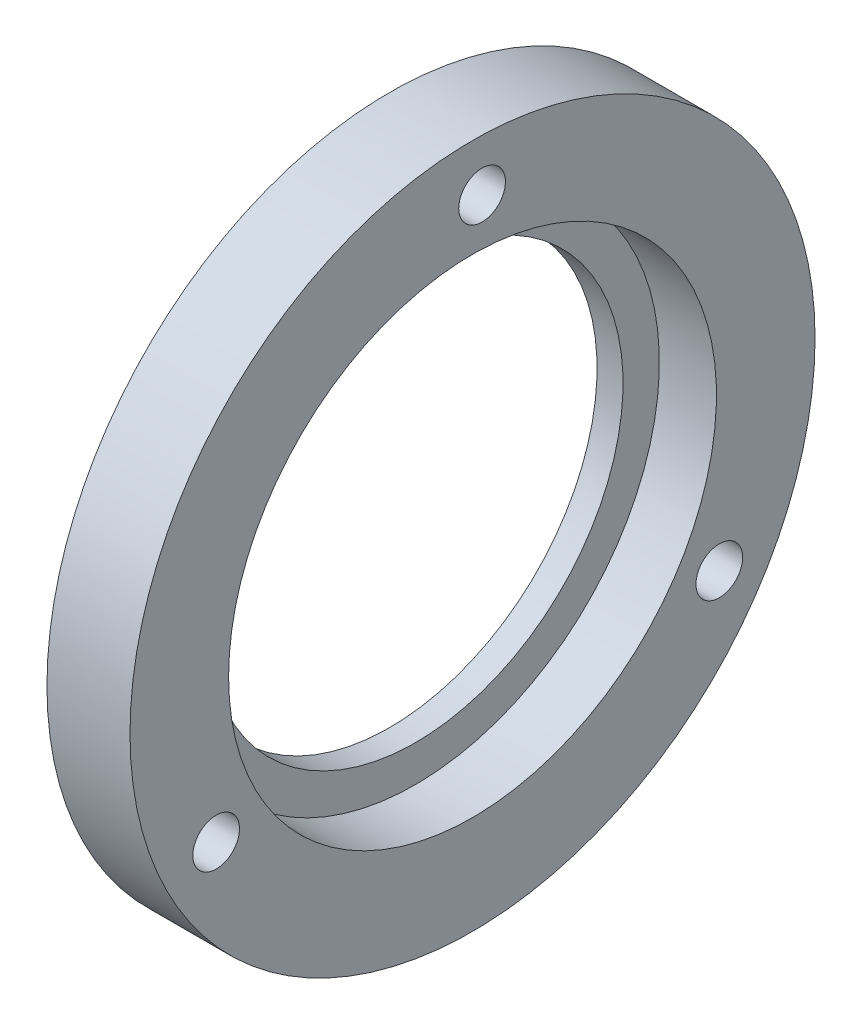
from build123d import *

# Parameters (mm, degrees)
CHAMBRAGE_POUR_VIS_T_TE_HEXAGONALE_M41_D           = 4.5
CHAMBRAGE_POUR_VIS_T_TE_HEXAGONALE_M41_CBORE_D     = 8
CHAMBRAGE_POUR_VIS_T_TE_HEXAGONALE_M41_CBORE_DEPTH = 4
R_P_TITION_CIRCULAIRE1_COUNT                       = 3


with BuildPart() as part:
    # Esquisse1 → R_volution1 (revolve)
    with BuildSketch(Plane.XY, mode=Mode.PRIVATE) as r_volution1_sk:
        Polygon((0, 20), (0, 33), (8, 33), (8, 23.5), (2.5, 23.5), (2.5, 20), align=None)
    revolve(r_volution1_sk.sketch.rotate(Axis((-15.138230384, 0, 0), (1, 0, 0)), 90), axis=Axis((-15.138230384, 0, 0), (1, 0, 0)))

    # Chambrage pour vis _ t_te hexagonale M41 (through all)
    with Locations(Plane(origin=(0, 27.984819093, -0.921900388), x_dir=(0, 0, -1), z_dir=(-1, 0, 0))):
        with Locations((0, 0)):
            chambrage_pour_vis_t_te_hexagonale_m41 = CounterBoreHole(CHAMBRAGE_POUR_VIS_T_TE_HEXAGONALE_M41_D / 2, CHAMBRAGE_POUR_VIS_T_TE_HEXAGONALE_M41_CBORE_D / 2, CHAMBRAGE_POUR_VIS_T_TE_HEXAGONALE_M41_CBORE_DEPTH)

    # R_p_tition circulaire1: Chambrage pour vis _ t_te hexagonale M41 ×3 about axis
    r_p_tition_circulaire1_axis = Axis((0, 0, 0), (1, 0, 0))
    for i in range(1, R_P_TITION_CIRCULAIRE1_COUNT):
        add(chambrage_pour_vis_t_te_hexagonale_m41.rotate(r_p_tition_circulaire1_axis, i * 360 / R_P_TITION_CIRCULAIRE1_COUNT), mode=Mode.SUBTRACT)


solid = part.part
